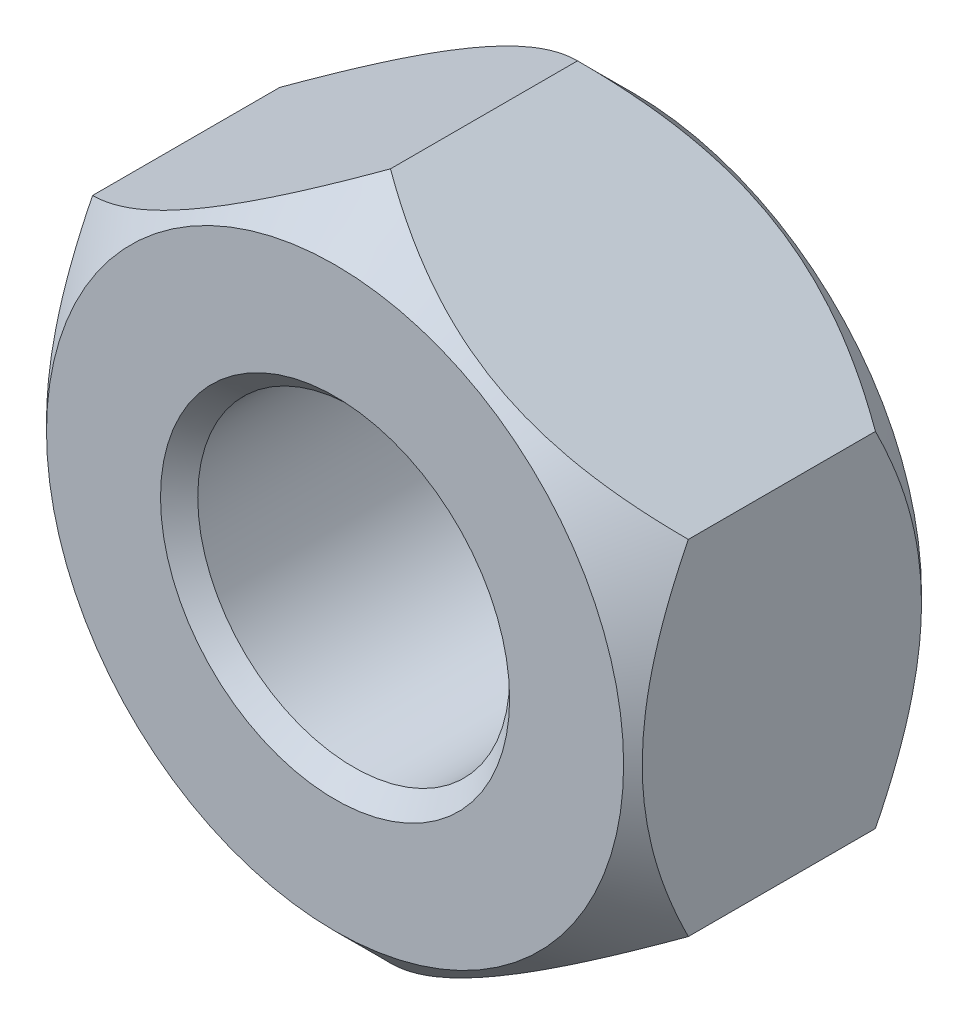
from build123d import *

# Parameters (mm, degrees)
SZKIC1_R                             = 4.188
DODANIE_WYCI_GNI_CIE1_DEPTH          = 4
SZKIC2_OUTSIDE_W                     = 54.356
SZKIC2_OUTSIDE_H                     = 56.832
SZKIC2_OUTSIDE_R                     = 7.75
WYTNIJ_WYCI_GNI_CIE1_DEPTH           = 15.605934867
WYTNIJ_WYCI_GNI_CIE1_TAPER           = 45
WYTNIJ_WYCI_GNI_CIE1_OTHER_WAY_DEPTH = 15.605934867
SFAZOWANIE1_SIZE                     = 0.5


with BuildPart() as part:
    # Szkic1 → Dodanie-wyci_gni_cie1 (new, symmetric)
    with BuildSketch(Plane.XY):
        Polygon((-8, 4.618802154), (-8, -4.618802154), (0, -9.237604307), (8, -4.618802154), (8, 4.618802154), (0, 9.237604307), align=None)
        Circle(SZKIC1_R, mode=Mode.SUBTRACT)
    extrude(amount=DODANIE_WYCI_GNI_CIE1_DEPTH, both=True)

    # Szkic2 outside → Wytnij-wyci_gni_cie1 (cut)
    with BuildSketch(Plane.XY.offset(4)):
        Rectangle(SZKIC2_OUTSIDE_W, SZKIC2_OUTSIDE_H)
        Circle(SZKIC2_OUTSIDE_R, mode=Mode.SUBTRACT)
    wytnij_wyci_gni_cie1 = extrude(amount=-WYTNIJ_WYCI_GNI_CIE1_DEPTH, taper=WYTNIJ_WYCI_GNI_CIE1_TAPER, mode=Mode.SUBTRACT)

    # Szkic2 outside → Wytnij-wyci_gni_cie1 other way (cut)
    with BuildSketch(Plane.XY.offset(4)):
        Rectangle(SZKIC2_OUTSIDE_W, SZKIC2_OUTSIDE_H)
        Circle(SZKIC2_OUTSIDE_R, mode=Mode.SUBTRACT)
    extrude(amount=WYTNIJ_WYCI_GNI_CIE1_OTHER_WAY_DEPTH, mode=Mode.SUBTRACT)

    # Lustro1: Wytnij-wyci_gni_cie1 across plane
    add(wytnij_wyci_gni_cie1.mirror(Plane.XY), mode=Mode.SUBTRACT)

    # Sfazowanie1
    sfazowanie1_edges = [part.edges().sort_by_distance(p)[0] for p in [
        (-4.188, 0, -4),
        (-4.188, 0, 4),
    ]]
    chamfer(sfazowanie1_edges, length=SFAZOWANIE1_SIZE)


solid = part.part
